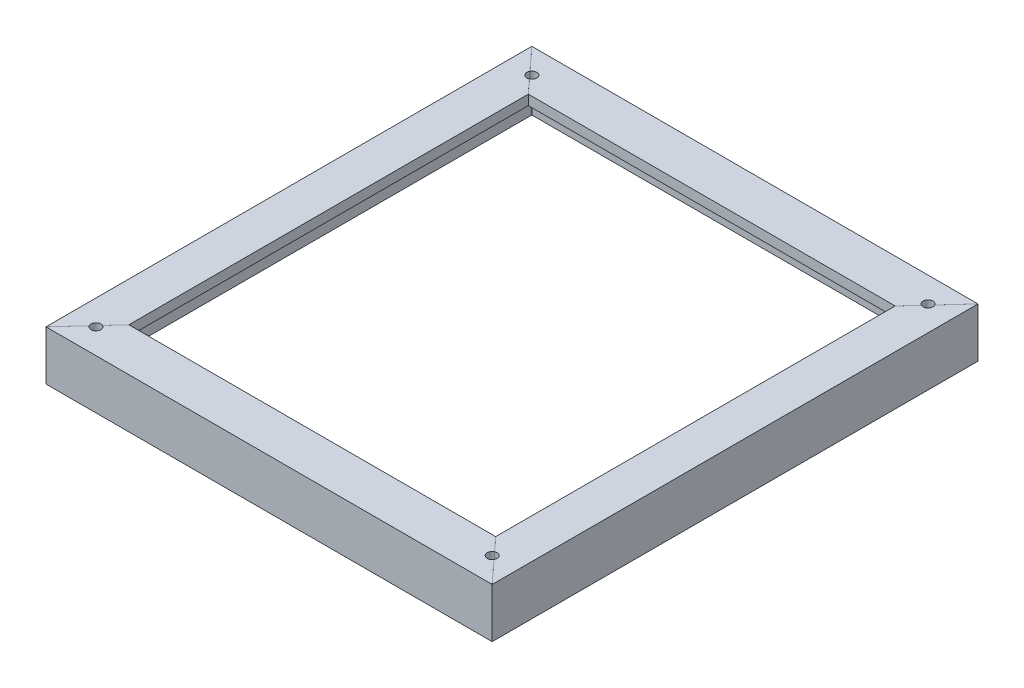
ISO-10303-21;
HEADER;
FILE_DESCRIPTION(('STEP AP214'),'2;1');
FILE_NAME('part.step','',(''),(''),'','','');
FILE_SCHEMA(('AUTOMOTIVE_DESIGN { 1 0 10303 214 1 1 1 1 }'));
ENDSEC;
DATA;
#1=APPLICATION_CONTEXT('core data for automotive mechanical design processes');
#2=APPLICATION_PROTOCOL_DEFINITION('international standard','automotive_design',2000,#1);
#3=PRODUCT_CONTEXT('',#1,'mechanical');
#4=PRODUCT('Part','Part','',(#3));
#5=PRODUCT_RELATED_PRODUCT_CATEGORY('part','',(#4));
#6=PRODUCT_DEFINITION_FORMATION('','',#4);
#7=PRODUCT_DEFINITION_CONTEXT('part definition',#1,'design');
#8=PRODUCT_DEFINITION('design','',#6,#7);
#9=PRODUCT_DEFINITION_SHAPE('','',#8);
#10=(LENGTH_UNIT() NAMED_UNIT(*) SI_UNIT(.MILLI.,.METRE.));
#11=(NAMED_UNIT(*) PLANE_ANGLE_UNIT() SI_UNIT($,.RADIAN.));
#12=(NAMED_UNIT(*) SI_UNIT($,.STERADIAN.) SOLID_ANGLE_UNIT());
#13=UNCERTAINTY_MEASURE_WITH_UNIT(LENGTH_MEASURE(1.E-05),#10,'distance_accuracy_value','');
#14=(GEOMETRIC_REPRESENTATION_CONTEXT(3) GLOBAL_UNCERTAINTY_ASSIGNED_CONTEXT((#13)) GLOBAL_UNIT_ASSIGNED_CONTEXT((#10,
#11,#12)) REPRESENTATION_CONTEXT('',''));
#15=CARTESIAN_POINT('',(0.,0.,0.));
#16=DIRECTION('',(0.,0.,1.));
#17=DIRECTION('',(1.,0.,0.));
#18=AXIS2_PLACEMENT_3D('',#15,#16,#17);
#19=CARTESIAN_POINT('',(0.,-3.175,0.));
#20=DIRECTION('',(0.,1.,0.));
#21=DIRECTION('',(0.,0.,1.));
#22=AXIS2_PLACEMENT_3D('',#19,#20,#21);
#23=PLANE('',#22);
#24=DIRECTION('',(-1.,0.,0.));
#25=VECTOR('',#24,1.);
#26=CARTESIAN_POINT('',(58.7375,-3.175,-63.9586111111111));
#27=LINE('',#26,#25);
#28=CARTESIAN_POINT('',(58.7340513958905,-3.175,-63.9586111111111));
#29=VERTEX_POINT('',#28);
#30=CARTESIAN_POINT('',(-58.7340513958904,-3.175,-63.9586111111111));
#31=VERTEX_POINT('',#30);
#32=EDGE_CURVE('E193',#29,#31,#27,.T.);
#33=ORIENTED_EDGE('',*,*,#32,.T.);
#34=DIRECTION('',(-0.676404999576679,0.,-0.736529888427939));
#35=VECTOR('',#34,1.);
#36=CARTESIAN_POINT('',(0.00187078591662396,-3.175,-0.00171806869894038));
#37=LINE('',#36,#35);
#38=CARTESIAN_POINT('',(-62.7632927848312,-3.175,-68.3460072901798));
#39=VERTEX_POINT('',#38);
#40=EDGE_CURVE('E145',#31,#39,#37,.T.);
#41=ORIENTED_EDGE('',*,*,#40,.T.);
#42=CARTESIAN_POINT('',(-63.4364999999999,-3.175,-69.7864999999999));
#43=DIRECTION('',(0.,-1.,0.));
#44=DIRECTION('',(0.,0.,-1.));
#45=AXIS2_PLACEMENT_3D('',#42,#43,#44);
#46=CIRCLE('',#45,1.59004);
#47=CARTESIAN_POINT('',(-64.8145946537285,-3.175,-70.5796471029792));
#48=VERTEX_POINT('',#47);
#49=EDGE_CURVE('E152',#48,#39,#46,.T.);
#50=ORIENTED_EDGE('',*,*,#49,.F.);
#51=CARTESIAN_POINT('',(-68.2624999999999,-3.175,-74.3340329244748));
#52=VERTEX_POINT('',#51);
#53=EDGE_CURVE('E137',#48,#52,#37,.T.);
#54=ORIENTED_EDGE('',*,*,#53,.T.);
#55=DIRECTION('',(0.,0.,-1.));
#56=VECTOR('',#55,1.);
#57=CARTESIAN_POINT('',(-68.2625,-3.175,-74.6125));
#58=LINE('',#57,#56);
#59=CARTESIAN_POINT('',(-68.2625,-3.175,-74.6125));
#60=VERTEX_POINT('',#59);
#61=EDGE_CURVE('E144',#52,#60,#58,.T.);
#62=ORIENTED_EDGE('',*,*,#61,.T.);
#63=DIRECTION('',(1.,0.,0.));
#64=VECTOR('',#63,1.);
#65=CARTESIAN_POINT('',(68.2625,-3.175,-74.6125));
#66=LINE('',#65,#64);
#67=CARTESIAN_POINT('',(68.2625,-3.175,-74.6125));
#68=VERTEX_POINT('',#67);
#69=EDGE_CURVE('E175',#60,#68,#66,.T.);
#70=ORIENTED_EDGE('',*,*,#69,.T.);
#71=DIRECTION('',(0.,0.,1.));
#72=VECTOR('',#71,1.);
#73=CARTESIAN_POINT('',(68.2625,-3.175,-74.6125));
#74=LINE('',#73,#72);
#75=CARTESIAN_POINT('',(68.2625,-3.175,-74.3340329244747));
#76=VERTEX_POINT('',#75);
#77=EDGE_CURVE('E176',#68,#76,#74,.T.);
#78=ORIENTED_EDGE('',*,*,#77,.T.);
#79=DIRECTION('',(-0.67640499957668,0.,0.736529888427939));
#80=VECTOR('',#79,1.);
#81=CARTESIAN_POINT('',(-0.00187078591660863,-3.175,-0.0017180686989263));
#82=LINE('',#81,#80);
#83=CARTESIAN_POINT('',(64.8145946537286,-3.175,-70.5796471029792));
#84=VERTEX_POINT('',#83);
#85=EDGE_CURVE('E178',#76,#84,#82,.T.);
#86=ORIENTED_EDGE('',*,*,#85,.T.);
#87=CARTESIAN_POINT('',(63.4364999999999,-3.175,-69.7864999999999));
#88=DIRECTION('',(0.,-1.,0.));
#89=DIRECTION('',(0.,0.,1.));
#90=AXIS2_PLACEMENT_3D('',#87,#88,#89);
#91=CIRCLE('',#90,1.59004000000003);
#92=CARTESIAN_POINT('',(62.7632927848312,-3.175,-68.3460072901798));
#93=VERTEX_POINT('',#92);
#94=EDGE_CURVE('E155',#93,#84,#91,.T.);
#95=ORIENTED_EDGE('',*,*,#94,.F.);
#96=EDGE_CURVE('E84',#93,#29,#82,.T.);
#97=ORIENTED_EDGE('',*,*,#96,.T.);
#98=EDGE_LOOP('',(#33,#41,#50,#54,#62,#70,#78,#86,#95,#97));
#99=FACE_BOUND('',#98,.T.);
#100=ADVANCED_FACE('F44',(#99),#23,.F.);
#101=CARTESIAN_POINT('',(0.,0.,0.));
#102=DIRECTION('',(0.,1.,0.));
#103=DIRECTION('',(0.,0.,1.));
#104=AXIS2_PLACEMENT_3D('',#101,#102,#103);
#105=PLANE('',#104);
#106=DIRECTION('',(-0.676404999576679,0.,-0.736529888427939));
#107=VECTOR('',#106,1.);
#108=CARTESIAN_POINT('',(-71.4356292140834,0.,-77.7892180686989));
#109=LINE('',#108,#107);
#110=CARTESIAN_POINT('',(-58.7340513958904,0.,-63.9586111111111));
#111=VERTEX_POINT('',#110);
#112=CARTESIAN_POINT('',(-62.7632927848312,0.,-68.3460072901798));
#113=VERTEX_POINT('',#112);
#114=EDGE_CURVE('E12',#111,#113,#109,.T.);
#115=ORIENTED_EDGE('',*,*,#114,.F.);
#116=DIRECTION('',(-1.,0.,0.));
#117=VECTOR('',#116,1.);
#118=CARTESIAN_POINT('',(58.7375,0.,-63.9586111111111));
#119=LINE('',#118,#117);
#120=CARTESIAN_POINT('',(58.7340513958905,0.,-63.9586111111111));
#121=VERTEX_POINT('',#120);
#122=EDGE_CURVE('E205',#121,#111,#119,.T.);
#123=ORIENTED_EDGE('',*,*,#122,.F.);
#124=DIRECTION('',(-0.67640499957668,0.,0.736529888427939));
#125=VECTOR('',#124,1.);
#126=CARTESIAN_POINT('',(71.4356292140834,0.,-77.7892180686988));
#127=LINE('',#126,#125);
#128=CARTESIAN_POINT('',(62.7632927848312,0.,-68.3460072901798));
#129=VERTEX_POINT('',#128);
#130=EDGE_CURVE('E198',#129,#121,#127,.T.);
#131=ORIENTED_EDGE('',*,*,#130,.F.);
#132=CARTESIAN_POINT('',(63.4364999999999,0.,-69.7864999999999));
#133=DIRECTION('',(0.,-1.,0.));
#134=DIRECTION('',(0.,0.,1.));
#135=AXIS2_PLACEMENT_3D('',#132,#133,#134);
#136=CIRCLE('',#135,1.59004000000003);
#137=CARTESIAN_POINT('',(64.8145946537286,0.,-70.5796471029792));
#138=VERTEX_POINT('',#137);
#139=EDGE_CURVE('E167',#129,#138,#136,.T.);
#140=ORIENTED_EDGE('',*,*,#139,.T.);
#141=CARTESIAN_POINT('',(71.4340513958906,0.,-77.7875));
#142=VERTEX_POINT('',#141);
#143=EDGE_CURVE('E215',#142,#138,#127,.T.);
#144=ORIENTED_EDGE('',*,*,#143,.F.);
#145=DIRECTION('',(-1.,0.,0.));
#146=VECTOR('',#145,1.);
#147=CARTESIAN_POINT('',(71.4375,0.,-77.7875));
#148=LINE('',#147,#146);
#149=CARTESIAN_POINT('',(-71.4340513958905,0.,-77.7875));
#150=VERTEX_POINT('',#149);
#151=EDGE_CURVE('E170',#142,#150,#148,.T.);
#152=ORIENTED_EDGE('',*,*,#151,.T.);
#153=CARTESIAN_POINT('',(-64.8145946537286,0.,-70.5796471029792));
#154=VERTEX_POINT('',#153);
#155=EDGE_CURVE('E53',#154,#150,#109,.T.);
#156=ORIENTED_EDGE('',*,*,#155,.F.);
#157=CARTESIAN_POINT('',(-63.4364999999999,0.,-69.7864999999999));
#158=DIRECTION('',(0.,-1.,0.));
#159=DIRECTION('',(0.,0.,-1.));
#160=AXIS2_PLACEMENT_3D('',#157,#158,#159);
#161=CIRCLE('',#160,1.59004);
#162=EDGE_CURVE('E154',#154,#113,#161,.T.);
#163=ORIENTED_EDGE('',*,*,#162,.T.);
#164=EDGE_LOOP('',(#115,#123,#131,#140,#144,#152,#156,#163));
#165=FACE_BOUND('',#164,.T.);
#166=ADVANCED_FACE('F235',(#165),#105,.T.);
#167=CARTESIAN_POINT('',(0.,-15.875,0.));
#168=DIRECTION('',(0.,-1.,0.));
#169=DIRECTION('',(0.,0.,-1.));
#170=AXIS2_PLACEMENT_3D('',#167,#168,#169);
#171=PLANE('',#170);
#172=DIRECTION('',(0.676404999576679,0.,0.736529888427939));
#173=VECTOR('',#172,1.);
#174=CARTESIAN_POINT('',(0.00187078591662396,-15.875,-0.00171806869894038));
#175=LINE('',#174,#173);
#176=CARTESIAN_POINT('',(-71.4340513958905,-15.875,-77.7875));
#177=VERTEX_POINT('',#176);
#178=CARTESIAN_POINT('',(-68.2625,-15.875,-74.3340329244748));
#179=VERTEX_POINT('',#178);
#180=EDGE_CURVE('E208',#177,#179,#175,.T.);
#181=ORIENTED_EDGE('',*,*,#180,.F.);
#182=DIRECTION('',(1.,0.,0.));
#183=VECTOR('',#182,1.);
#184=CARTESIAN_POINT('',(-71.4375,-15.875,-77.7875));
#185=LINE('',#184,#183);
#186=CARTESIAN_POINT('',(71.4340513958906,-15.875,-77.7875));
#187=VERTEX_POINT('',#186);
#188=EDGE_CURVE('E180',#177,#187,#185,.T.);
#189=ORIENTED_EDGE('',*,*,#188,.T.);
#190=DIRECTION('',(0.67640499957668,0.,-0.736529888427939));
#191=VECTOR('',#190,1.);
#192=CARTESIAN_POINT('',(-0.00187078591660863,-15.875,-0.0017180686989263));
#193=LINE('',#192,#191);
#194=CARTESIAN_POINT('',(68.2625,-15.875,-74.3340329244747));
#195=VERTEX_POINT('',#194);
#196=EDGE_CURVE('E209',#195,#187,#193,.T.);
#197=ORIENTED_EDGE('',*,*,#196,.F.);
#198=DIRECTION('',(0.,0.,1.));
#199=VECTOR('',#198,1.);
#200=CARTESIAN_POINT('',(68.2625,-15.875,-74.6125));
#201=LINE('',#200,#199);
#202=CARTESIAN_POINT('',(68.2625,-15.875,-74.6125));
#203=VERTEX_POINT('',#202);
#204=EDGE_CURVE('E47',#203,#195,#201,.T.);
#205=ORIENTED_EDGE('',*,*,#204,.F.);
#206=DIRECTION('',(1.,0.,0.));
#207=VECTOR('',#206,1.);
#208=CARTESIAN_POINT('',(68.2625,-15.875,-74.6125));
#209=LINE('',#208,#207);
#210=CARTESIAN_POINT('',(-68.2625,-15.875,-74.6125));
#211=VERTEX_POINT('',#210);
#212=EDGE_CURVE('E199',#211,#203,#209,.T.);
#213=ORIENTED_EDGE('',*,*,#212,.F.);
#214=DIRECTION('',(0.,0.,-1.));
#215=VECTOR('',#214,1.);
#216=CARTESIAN_POINT('',(-68.2625,-15.875,-74.6125));
#217=LINE('',#216,#215);
#218=EDGE_CURVE('E179',#179,#211,#217,.T.);
#219=ORIENTED_EDGE('',*,*,#218,.F.);
#220=EDGE_LOOP('',(#181,#189,#197,#205,#213,#219));
#221=FACE_BOUND('',#220,.T.);
#222=ADVANCED_FACE('F243',(#221),#171,.T.);
#223=CARTESIAN_POINT('',(-68.2625,-15.875,-74.6125));
#224=DIRECTION('',(1.,0.,0.));
#225=DIRECTION('',(0.,0.,-1.));
#226=AXIS2_PLACEMENT_3D('',#223,#224,#225);
#227=PLANE('',#226);
#228=DIRECTION('',(0.,1.,0.));
#229=VECTOR('',#228,1.);
#230=CARTESIAN_POINT('',(-68.2625,-15.875,-74.3340329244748));
#231=LINE('',#230,#229);
#232=EDGE_CURVE('E140',#179,#52,#231,.T.);
#233=ORIENTED_EDGE('',*,*,#232,.F.);
#234=ORIENTED_EDGE('',*,*,#218,.T.);
#235=DIRECTION('',(0.,1.,0.));
#236=VECTOR('',#235,1.);
#237=CARTESIAN_POINT('',(-68.2625,-15.875,-74.6125));
#238=LINE('',#237,#236);
#239=EDGE_CURVE('E163',#211,#60,#238,.T.);
#240=ORIENTED_EDGE('',*,*,#239,.T.);
#241=ORIENTED_EDGE('',*,*,#61,.F.);
#242=EDGE_LOOP('',(#233,#234,#240,#241));
#243=FACE_BOUND('',#242,.T.);
#244=ADVANCED_FACE('F254',(#243),#227,.T.);
#245=CARTESIAN_POINT('',(68.2625,-15.875,-74.6125));
#246=DIRECTION('',(-1.,0.,0.));
#247=DIRECTION('',(0.,0.,1.));
#248=AXIS2_PLACEMENT_3D('',#245,#246,#247);
#249=PLANE('',#248);
#250=DIRECTION('',(0.,-1.,0.));
#251=VECTOR('',#250,1.);
#252=CARTESIAN_POINT('',(68.2625,-15.875,-74.3340329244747));
#253=LINE('',#252,#251);
#254=EDGE_CURVE('E217',#76,#195,#253,.T.);
#255=ORIENTED_EDGE('',*,*,#254,.F.);
#256=ORIENTED_EDGE('',*,*,#77,.F.);
#257=DIRECTION('',(0.,1.,0.));
#258=VECTOR('',#257,1.);
#259=CARTESIAN_POINT('',(68.2625,-15.875,-74.6125));
#260=LINE('',#259,#258);
#261=EDGE_CURVE('E196',#203,#68,#260,.T.);
#262=ORIENTED_EDGE('',*,*,#261,.F.);
#263=ORIENTED_EDGE('',*,*,#204,.T.);
#264=EDGE_LOOP('',(#255,#256,#262,#263));
#265=FACE_BOUND('',#264,.T.);
#266=ADVANCED_FACE('F253',(#265),#249,.T.);
#267=CARTESIAN_POINT('',(-63.4364999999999,0.,-69.7864999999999));
#268=DIRECTION('',(0.,-1.,0.));
#269=DIRECTION('',(0.,0.,-1.));
#270=AXIS2_PLACEMENT_3D('',#267,#268,#269);
#271=CYLINDRICAL_SURFACE('',#270,1.59004);
#272=ORIENTED_EDGE('',*,*,#49,.T.);
#273=DIRECTION('',(0.,-1.,0.));
#274=VECTOR('',#273,1.);
#275=CARTESIAN_POINT('',(-62.7632927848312,0.,-68.3460072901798));
#276=LINE('',#275,#274);
#277=EDGE_CURVE('E156',#39,#113,#276,.F.);
#278=ORIENTED_EDGE('',*,*,#277,.T.);
#279=ORIENTED_EDGE('',*,*,#162,.F.);
#280=DIRECTION('',(0.,-1.,0.));
#281=VECTOR('',#280,1.);
#282=CARTESIAN_POINT('',(-64.8145946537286,0.,-70.5796471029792));
#283=LINE('',#282,#281);
#284=EDGE_CURVE('E135',#154,#48,#283,.T.);
#285=ORIENTED_EDGE('',*,*,#284,.T.);
#286=EDGE_LOOP('',(#272,#278,#279,#285));
#287=FACE_BOUND('',#286,.T.);
#288=ADVANCED_FACE('F150',(#287),#271,.F.);
#289=CARTESIAN_POINT('',(63.4364999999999,0.,-69.7864999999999));
#290=DIRECTION('',(0.,-1.,0.));
#291=DIRECTION('',(0.,0.,-1.));
#292=AXIS2_PLACEMENT_3D('',#289,#290,#291);
#293=CYLINDRICAL_SURFACE('',#292,1.59004000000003);
#294=ORIENTED_EDGE('',*,*,#94,.T.);
#295=DIRECTION('',(0.,-1.,0.));
#296=VECTOR('',#295,1.);
#297=CARTESIAN_POINT('',(64.8145946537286,0.,-70.5796471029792));
#298=LINE('',#297,#296);
#299=EDGE_CURVE('E173',#84,#138,#298,.F.);
#300=ORIENTED_EDGE('',*,*,#299,.T.);
#301=ORIENTED_EDGE('',*,*,#139,.F.);
#302=DIRECTION('',(0.,-1.,0.));
#303=VECTOR('',#302,1.);
#304=CARTESIAN_POINT('',(62.7632927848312,0.,-68.3460072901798));
#305=LINE('',#304,#303);
#306=EDGE_CURVE('E78',#129,#93,#305,.T.);
#307=ORIENTED_EDGE('',*,*,#306,.T.);
#308=EDGE_LOOP('',(#294,#300,#301,#307));
#309=FACE_BOUND('',#308,.T.);
#310=ADVANCED_FACE('F232',(#309),#293,.F.);
#311=CARTESIAN_POINT('',(71.4375,-3.175,-77.7875));
#312=DIRECTION('',(0.,0.,-1.));
#313=DIRECTION('',(-1.,0.,0.));
#314=AXIS2_PLACEMENT_3D('',#311,#312,#313);
#315=PLANE('',#314);
#316=DIRECTION('',(0.,-1.,0.));
#317=VECTOR('',#316,1.);
#318=CARTESIAN_POINT('',(-71.4340513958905,-3.175,-77.7875));
#319=LINE('',#318,#317);
#320=EDGE_CURVE('E206',#150,#177,#319,.T.);
#321=ORIENTED_EDGE('',*,*,#320,.F.);
#322=ORIENTED_EDGE('',*,*,#151,.F.);
#323=DIRECTION('',(0.,1.,0.));
#324=VECTOR('',#323,1.);
#325=CARTESIAN_POINT('',(71.4340513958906,-3.175,-77.7875));
#326=LINE('',#325,#324);
#327=EDGE_CURVE('E212',#187,#142,#326,.T.);
#328=ORIENTED_EDGE('',*,*,#327,.F.);
#329=ORIENTED_EDGE('',*,*,#188,.F.);
#330=EDGE_LOOP('',(#321,#322,#328,#329));
#331=FACE_BOUND('',#330,.T.);
#332=ADVANCED_FACE('F242',(#331),#315,.T.);
#333=CARTESIAN_POINT('',(58.7375,-3.175,-63.9586111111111));
#334=DIRECTION('',(0.,0.,-1.));
#335=DIRECTION('',(-1.,0.,0.));
#336=AXIS2_PLACEMENT_3D('',#333,#334,#335);
#337=PLANE('',#336);
#338=ORIENTED_EDGE('',*,*,#122,.T.);
#339=DIRECTION('',(0.,-1.,0.));
#340=VECTOR('',#339,1.);
#341=CARTESIAN_POINT('',(-58.7340513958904,-3.175,-63.9586111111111));
#342=LINE('',#341,#340);
#343=EDGE_CURVE('E61',#111,#31,#342,.T.);
#344=ORIENTED_EDGE('',*,*,#343,.T.);
#345=ORIENTED_EDGE('',*,*,#32,.F.);
#346=DIRECTION('',(0.,1.,0.));
#347=VECTOR('',#346,1.);
#348=CARTESIAN_POINT('',(58.7340513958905,-3.175,-63.9586111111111));
#349=LINE('',#348,#347);
#350=EDGE_CURVE('E203',#29,#121,#349,.T.);
#351=ORIENTED_EDGE('',*,*,#350,.T.);
#352=EDGE_LOOP('',(#338,#344,#345,#351));
#353=FACE_BOUND('',#352,.T.);
#354=ADVANCED_FACE('F308',(#353),#337,.F.);
#355=CARTESIAN_POINT('',(68.2625,-15.875,-74.6125));
#356=DIRECTION('',(0.,0.,1.));
#357=DIRECTION('',(1.,0.,0.));
#358=AXIS2_PLACEMENT_3D('',#355,#356,#357);
#359=PLANE('',#358);
#360=ORIENTED_EDGE('',*,*,#69,.F.);
#361=ORIENTED_EDGE('',*,*,#239,.F.);
#362=ORIENTED_EDGE('',*,*,#212,.T.);
#363=ORIENTED_EDGE('',*,*,#261,.T.);
#364=EDGE_LOOP('',(#360,#361,#362,#363));
#365=FACE_BOUND('',#364,.T.);
#366=ADVANCED_FACE('F249',(#365),#359,.T.);
#367=CARTESIAN_POINT('',(71.4356292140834,-2540.,-77.7892180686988));
#368=DIRECTION('',(-0.736529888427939,0.,-0.676404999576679));
#369=DIRECTION('',(-0.67640499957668,0.,0.736529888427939));
#370=AXIS2_PLACEMENT_3D('',#367,#368,#369);
#371=PLANE('',#370);
#372=ORIENTED_EDGE('',*,*,#96,.F.);
#373=ORIENTED_EDGE('',*,*,#306,.F.);
#374=ORIENTED_EDGE('',*,*,#130,.T.);
#375=ORIENTED_EDGE('',*,*,#350,.F.);
#376=EDGE_LOOP('',(#372,#373,#374,#375));
#377=FACE_BOUND('',#376,.T.);
#378=ADVANCED_FACE('F326',(#377),#371,.F.);
#379=ORIENTED_EDGE('',*,*,#327,.T.);
#380=ORIENTED_EDGE('',*,*,#143,.T.);
#381=ORIENTED_EDGE('',*,*,#299,.F.);
#382=ORIENTED_EDGE('',*,*,#85,.F.);
#383=ORIENTED_EDGE('',*,*,#254,.T.);
#384=ORIENTED_EDGE('',*,*,#196,.T.);
#385=EDGE_LOOP('',(#379,#380,#381,#382,#383,#384));
#386=FACE_BOUND('',#385,.T.);
#387=ADVANCED_FACE('F224',(#386),#371,.F.);
#388=CARTESIAN_POINT('',(-71.4356292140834,-2540.,-77.7892180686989));
#389=DIRECTION('',(0.736529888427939,0.,-0.676404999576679));
#390=DIRECTION('',(-0.676404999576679,0.,-0.736529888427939));
#391=AXIS2_PLACEMENT_3D('',#388,#389,#390);
#392=PLANE('',#391);
#393=ORIENTED_EDGE('',*,*,#320,.T.);
#394=ORIENTED_EDGE('',*,*,#180,.T.);
#395=ORIENTED_EDGE('',*,*,#232,.T.);
#396=ORIENTED_EDGE('',*,*,#53,.F.);
#397=ORIENTED_EDGE('',*,*,#284,.F.);
#398=ORIENTED_EDGE('',*,*,#155,.T.);
#399=EDGE_LOOP('',(#393,#394,#395,#396,#397,#398));
#400=FACE_BOUND('',#399,.T.);
#401=ADVANCED_FACE('F138',(#400),#392,.F.);
#402=ORIENTED_EDGE('',*,*,#114,.T.);
#403=ORIENTED_EDGE('',*,*,#277,.F.);
#404=ORIENTED_EDGE('',*,*,#40,.F.);
#405=ORIENTED_EDGE('',*,*,#343,.F.);
#406=EDGE_LOOP('',(#402,#403,#404,#405));
#407=FACE_BOUND('',#406,.T.);
#408=ADVANCED_FACE('F350',(#407),#392,.F.);
#409=CLOSED_SHELL('',(#100,#166,#222,#244,#266,#288,#310,#332,#354,#366,#378,#387,#401,#408));
#410=MANIFOLD_SOLID_BREP('B2',#409);
#411=CARTESIAN_POINT('',(68.2625,-15.875,74.6125));
#412=DIRECTION('',(0.,0.,-1.));
#413=DIRECTION('',(-1.,0.,0.));
#414=AXIS2_PLACEMENT_3D('',#411,#412,#413);
#415=PLANE('',#414);
#416=DIRECTION('',(-1.,0.,0.));
#417=VECTOR('',#416,1.);
#418=CARTESIAN_POINT('',(68.2625,-3.175,74.6125));
#419=LINE('',#418,#417);
#420=CARTESIAN_POINT('',(68.2625,-3.175,74.6125));
#421=VERTEX_POINT('',#420);
#422=CARTESIAN_POINT('',(-68.2625,-3.175,74.6125));
#423=VERTEX_POINT('',#422);
#424=EDGE_CURVE('E479',#421,#423,#419,.T.);
#425=ORIENTED_EDGE('',*,*,#424,.F.);
#426=DIRECTION('',(0.,1.,0.));
#427=VECTOR('',#426,1.);
#428=CARTESIAN_POINT('',(68.2625,-15.875,74.6125));
#429=LINE('',#428,#427);
#430=CARTESIAN_POINT('',(68.2625,-15.875,74.6125));
#431=VERTEX_POINT('',#430);
#432=EDGE_CURVE('E485',#431,#421,#429,.T.);
#433=ORIENTED_EDGE('',*,*,#432,.F.);
#434=DIRECTION('',(-1.,0.,0.));
#435=VECTOR('',#434,1.);
#436=CARTESIAN_POINT('',(68.2625,-15.875,74.6125));
#437=LINE('',#436,#435);
#438=CARTESIAN_POINT('',(-68.2625,-15.875,74.6125));
#439=VERTEX_POINT('',#438);
#440=EDGE_CURVE('E502',#431,#439,#437,.T.);
#441=ORIENTED_EDGE('',*,*,#440,.T.);
#442=DIRECTION('',(0.,1.,0.));
#443=VECTOR('',#442,1.);
#444=CARTESIAN_POINT('',(-68.2625,-15.875,74.6125));
#445=LINE('',#444,#443);
#446=EDGE_CURVE('E494',#439,#423,#445,.T.);
#447=ORIENTED_EDGE('',*,*,#446,.T.);
#448=EDGE_LOOP('',(#425,#433,#441,#447));
#449=FACE_BOUND('',#448,.T.);
#450=ADVANCED_FACE('F383',(#449),#415,.T.);
#451=CARTESIAN_POINT('',(68.2625,-15.875,-74.6125));
#452=DIRECTION('',(-1.,0.,0.));
#453=DIRECTION('',(0.,0.,1.));
#454=AXIS2_PLACEMENT_3D('',#451,#452,#453);
#455=PLANE('',#454);
#456=DIRECTION('',(0.,1.,0.));
#457=VECTOR('',#456,1.);
#458=CARTESIAN_POINT('',(68.2625,-15.875,74.3340329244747));
#459=LINE('',#458,#457);
#460=CARTESIAN_POINT('',(68.2625,-15.875,74.3340329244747));
#461=VERTEX_POINT('',#460);
#462=CARTESIAN_POINT('',(68.2625,-3.175,74.3340329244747));
#463=VERTEX_POINT('',#462);
#464=EDGE_CURVE('E522',#461,#463,#459,.T.);
#465=ORIENTED_EDGE('',*,*,#464,.F.);
#466=DIRECTION('',(0.,0.,1.));
#467=VECTOR('',#466,1.);
#468=CARTESIAN_POINT('',(68.2625,-15.875,-74.6125));
#469=LINE('',#468,#467);
#470=EDGE_CURVE('E387',#461,#431,#469,.T.);
#471=ORIENTED_EDGE('',*,*,#470,.T.);
#472=ORIENTED_EDGE('',*,*,#432,.T.);
#473=DIRECTION('',(0.,0.,1.));
#474=VECTOR('',#473,1.);
#475=CARTESIAN_POINT('',(68.2625,-3.175,-74.6125));
#476=LINE('',#475,#474);
#477=EDGE_CURVE('E474',#463,#421,#476,.T.);
#478=ORIENTED_EDGE('',*,*,#477,.F.);
#479=EDGE_LOOP('',(#465,#471,#472,#478));
#480=FACE_BOUND('',#479,.T.);
#481=ADVANCED_FACE('F486',(#480),#455,.T.);
#482=CARTESIAN_POINT('',(-68.2625,-15.875,-74.6125));
#483=DIRECTION('',(1.,0.,0.));
#484=DIRECTION('',(0.,0.,-1.));
#485=AXIS2_PLACEMENT_3D('',#482,#483,#484);
#486=PLANE('',#485);
#487=DIRECTION('',(0.,-1.,0.));
#488=VECTOR('',#487,1.);
#489=CARTESIAN_POINT('',(-68.2625,-15.875,74.3340329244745));
#490=LINE('',#489,#488);
#491=CARTESIAN_POINT('',(-68.2625,-3.175,74.3340329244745));
#492=VERTEX_POINT('',#491);
#493=CARTESIAN_POINT('',(-68.2625,-15.875,74.3340329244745));
#494=VERTEX_POINT('',#493);
#495=EDGE_CURVE('E393',#492,#494,#490,.T.);
#496=ORIENTED_EDGE('',*,*,#495,.F.);
#497=DIRECTION('',(0.,0.,-1.));
#498=VECTOR('',#497,1.);
#499=CARTESIAN_POINT('',(-68.2625,-3.175,-74.6125));
#500=LINE('',#499,#498);
#501=EDGE_CURVE('E496',#423,#492,#500,.T.);
#502=ORIENTED_EDGE('',*,*,#501,.F.);
#503=ORIENTED_EDGE('',*,*,#446,.F.);
#504=DIRECTION('',(0.,0.,-1.));
#505=VECTOR('',#504,1.);
#506=CARTESIAN_POINT('',(-68.2625,-15.875,-74.6125));
#507=LINE('',#506,#505);
#508=EDGE_CURVE('E491',#439,#494,#507,.T.);
#509=ORIENTED_EDGE('',*,*,#508,.T.);
#510=EDGE_LOOP('',(#496,#502,#503,#509));
#511=FACE_BOUND('',#510,.T.);
#512=ADVANCED_FACE('F585',(#511),#486,.T.);
#513=CARTESIAN_POINT('',(0.,-15.875,0.));
#514=DIRECTION('',(0.,-1.,0.));
#515=DIRECTION('',(0.,0.,-1.));
#516=AXIS2_PLACEMENT_3D('',#513,#514,#515);
#517=PLANE('',#516);
#518=DIRECTION('',(-0.676404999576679,0.,-0.736529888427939));
#519=VECTOR('',#518,1.);
#520=CARTESIAN_POINT('',(-0.00187078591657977,-15.875,0.00171806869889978));
#521=LINE('',#520,#519);
#522=CARTESIAN_POINT('',(71.4340513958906,-15.875,77.7875));
#523=VERTEX_POINT('',#522);
#524=EDGE_CURVE('E520',#523,#461,#521,.T.);
#525=ORIENTED_EDGE('',*,*,#524,.F.);
#526=DIRECTION('',(-1.,0.,0.));
#527=VECTOR('',#526,1.);
#528=CARTESIAN_POINT('',(71.4375,-15.875,77.7875));
#529=LINE('',#528,#527);
#530=CARTESIAN_POINT('',(-71.4340513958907,-15.875,77.7875));
#531=VERTEX_POINT('',#530);
#532=EDGE_CURVE('E531',#523,#531,#529,.T.);
#533=ORIENTED_EDGE('',*,*,#532,.T.);
#534=DIRECTION('',(-0.67640499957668,0.,0.736529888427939));
#535=VECTOR('',#534,1.);
#536=CARTESIAN_POINT('',(0.00187078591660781,-15.875,0.00171806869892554));
#537=LINE('',#536,#535);
#538=EDGE_CURVE('E42',#494,#531,#537,.T.);
#539=ORIENTED_EDGE('',*,*,#538,.F.);
#540=ORIENTED_EDGE('',*,*,#508,.F.);
#541=ORIENTED_EDGE('',*,*,#440,.F.);
#542=ORIENTED_EDGE('',*,*,#470,.F.);
#543=EDGE_LOOP('',(#525,#533,#539,#540,#541,#542));
#544=FACE_BOUND('',#543,.T.);
#545=ADVANCED_FACE('F587',(#544),#517,.T.);
#546=CARTESIAN_POINT('',(63.4364999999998,0.,69.7865));
#547=DIRECTION('',(0.,-1.,0.));
#548=DIRECTION('',(0.,0.,-1.));
#549=AXIS2_PLACEMENT_3D('',#546,#547,#548);
#550=CYLINDRICAL_SURFACE('',#549,1.59004);
#551=CARTESIAN_POINT('',(63.4364999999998,-3.175,69.7865));
#552=DIRECTION('',(0.,-1.,0.));
#553=DIRECTION('',(0.,0.,1.));
#554=AXIS2_PLACEMENT_3D('',#551,#552,#553);
#555=CIRCLE('',#554,1.59004);
#556=CARTESIAN_POINT('',(64.8145946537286,-3.175,70.5796471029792));
#557=VERTEX_POINT('',#556);
#558=CARTESIAN_POINT('',(62.7632927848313,-3.175,68.3460072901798));
#559=VERTEX_POINT('',#558);
#560=EDGE_CURVE('E545',#557,#559,#555,.T.);
#561=ORIENTED_EDGE('',*,*,#560,.T.);
#562=DIRECTION('',(0.,-1.,0.));
#563=VECTOR('',#562,1.);
#564=CARTESIAN_POINT('',(62.7632927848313,0.,68.3460072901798));
#565=LINE('',#564,#563);
#566=CARTESIAN_POINT('',(62.7632927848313,0.,68.3460072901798));
#567=VERTEX_POINT('',#566);
#568=EDGE_CURVE('E547',#559,#567,#565,.F.);
#569=ORIENTED_EDGE('',*,*,#568,.T.);
#570=CARTESIAN_POINT('',(63.4364999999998,0.,69.7865));
#571=DIRECTION('',(0.,-1.,0.));
#572=DIRECTION('',(0.,0.,1.));
#573=AXIS2_PLACEMENT_3D('',#570,#571,#572);
#574=CIRCLE('',#573,1.59004);
#575=CARTESIAN_POINT('',(64.8145946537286,0.,70.5796471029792));
#576=VERTEX_POINT('',#575);
#577=EDGE_CURVE('E541',#576,#567,#574,.T.);
#578=ORIENTED_EDGE('',*,*,#577,.F.);
#579=DIRECTION('',(0.,-1.,0.));
#580=VECTOR('',#579,1.);
#581=CARTESIAN_POINT('',(64.8145946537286,0.,70.5796471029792));
#582=LINE('',#581,#580);
#583=EDGE_CURVE('E540',#576,#557,#582,.T.);
#584=ORIENTED_EDGE('',*,*,#583,.T.);
#585=EDGE_LOOP('',(#561,#569,#578,#584));
#586=FACE_BOUND('',#585,.T.);
#587=ADVANCED_FACE('F594',(#586),#550,.F.);
#588=CARTESIAN_POINT('',(-63.4364999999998,0.,69.7865));
#589=DIRECTION('',(0.,-1.,0.));
#590=DIRECTION('',(0.,0.,-1.));
#591=AXIS2_PLACEMENT_3D('',#588,#589,#590);
#592=CYLINDRICAL_SURFACE('',#591,1.59004000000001);
#593=CARTESIAN_POINT('',(-63.4364999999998,-3.175,69.7865));
#594=DIRECTION('',(0.,-1.,0.));
#595=DIRECTION('',(0.,0.,-1.));
#596=AXIS2_PLACEMENT_3D('',#593,#594,#595);
#597=CIRCLE('',#596,1.59004000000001);
#598=CARTESIAN_POINT('',(-62.7632927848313,-3.175,68.3460072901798));
#599=VERTEX_POINT('',#598);
#600=CARTESIAN_POINT('',(-64.8145946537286,-3.175,70.5796471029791));
#601=VERTEX_POINT('',#600);
#602=EDGE_CURVE('E536',#599,#601,#597,.T.);
#603=ORIENTED_EDGE('',*,*,#602,.T.);
#604=DIRECTION('',(0.,-1.,0.));
#605=VECTOR('',#604,1.);
#606=CARTESIAN_POINT('',(-64.8145946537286,0.,70.5796471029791));
#607=LINE('',#606,#605);
#608=CARTESIAN_POINT('',(-64.8145946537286,0.,70.5796471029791));
#609=VERTEX_POINT('',#608);
#610=EDGE_CURVE('E539',#601,#609,#607,.F.);
#611=ORIENTED_EDGE('',*,*,#610,.T.);
#612=CARTESIAN_POINT('',(-63.4364999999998,0.,69.7865));
#613=DIRECTION('',(0.,-1.,0.));
#614=DIRECTION('',(0.,0.,-1.));
#615=AXIS2_PLACEMENT_3D('',#612,#613,#614);
#616=CIRCLE('',#615,1.59004000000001);
#617=CARTESIAN_POINT('',(-62.7632927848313,0.,68.3460072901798));
#618=VERTEX_POINT('',#617);
#619=EDGE_CURVE('E512',#618,#609,#616,.T.);
#620=ORIENTED_EDGE('',*,*,#619,.F.);
#621=DIRECTION('',(0.,-1.,0.));
#622=VECTOR('',#621,1.);
#623=CARTESIAN_POINT('',(-62.7632927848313,0.,68.3460072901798));
#624=LINE('',#623,#622);
#625=EDGE_CURVE('E452',#618,#599,#624,.T.);
#626=ORIENTED_EDGE('',*,*,#625,.T.);
#627=EDGE_LOOP('',(#603,#611,#620,#626));
#628=FACE_BOUND('',#627,.T.);
#629=ADVANCED_FACE('F568',(#628),#592,.F.);
#630=CARTESIAN_POINT('',(58.7375,-3.175,63.9586111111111));
#631=DIRECTION('',(0.,0.,1.));
#632=DIRECTION('',(1.,0.,0.));
#633=AXIS2_PLACEMENT_3D('',#630,#631,#632);
#634=PLANE('',#633);
#635=DIRECTION('',(1.,0.,0.));
#636=VECTOR('',#635,1.);
#637=CARTESIAN_POINT('',(58.7375,0.,63.9586111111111));
#638=LINE('',#637,#636);
#639=CARTESIAN_POINT('',(-58.7340513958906,0.,63.9586111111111));
#640=VERTEX_POINT('',#639);
#641=CARTESIAN_POINT('',(58.7340513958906,0.,63.9586111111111));
#642=VERTEX_POINT('',#641);
#643=EDGE_CURVE('E518',#640,#642,#638,.T.);
#644=ORIENTED_EDGE('',*,*,#643,.T.);
#645=DIRECTION('',(0.,-1.,0.));
#646=VECTOR('',#645,1.);
#647=CARTESIAN_POINT('',(58.7340513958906,-3.175,63.9586111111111));
#648=LINE('',#647,#646);
#649=CARTESIAN_POINT('',(58.7340513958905,-3.175,63.9586111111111));
#650=VERTEX_POINT('',#649);
#651=EDGE_CURVE('E513',#642,#650,#648,.T.);
#652=ORIENTED_EDGE('',*,*,#651,.T.);
#653=DIRECTION('',(1.,0.,0.));
#654=VECTOR('',#653,1.);
#655=CARTESIAN_POINT('',(58.7375,-3.175,63.9586111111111));
#656=LINE('',#655,#654);
#657=CARTESIAN_POINT('',(-58.7340513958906,-3.175,63.9586111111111));
#658=VERTEX_POINT('',#657);
#659=EDGE_CURVE('E544',#658,#650,#656,.T.);
#660=ORIENTED_EDGE('',*,*,#659,.F.);
#661=DIRECTION('',(0.,1.,0.));
#662=VECTOR('',#661,1.);
#663=CARTESIAN_POINT('',(-58.7340513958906,-3.175,63.9586111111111));
#664=LINE('',#663,#662);
#665=EDGE_CURVE('E509',#658,#640,#664,.T.);
#666=ORIENTED_EDGE('',*,*,#665,.T.);
#667=EDGE_LOOP('',(#644,#652,#660,#666));
#668=FACE_BOUND('',#667,.T.);
#669=ADVANCED_FACE('F580',(#668),#634,.F.);
#670=CARTESIAN_POINT('',(0.,0.,0.));
#671=DIRECTION('',(0.,1.,0.));
#672=DIRECTION('',(0.,0.,1.));
#673=AXIS2_PLACEMENT_3D('',#670,#671,#672);
#674=PLANE('',#673);
#675=DIRECTION('',(0.676404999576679,0.,0.736529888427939));
#676=VECTOR('',#675,1.);
#677=CARTESIAN_POINT('',(0.,0.,0.00375514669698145));
#678=LINE('',#677,#676);
#679=EDGE_CURVE('E528',#642,#567,#678,.T.);
#680=ORIENTED_EDGE('',*,*,#679,.F.);
#681=ORIENTED_EDGE('',*,*,#643,.F.);
#682=DIRECTION('',(0.67640499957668,0.,-0.736529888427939));
#683=VECTOR('',#682,1.);
#684=CARTESIAN_POINT('',(0.,0.,0.00375514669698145));
#685=LINE('',#684,#683);
#686=EDGE_CURVE('E506',#618,#640,#685,.T.);
#687=ORIENTED_EDGE('',*,*,#686,.F.);
#688=ORIENTED_EDGE('',*,*,#619,.T.);
#689=CARTESIAN_POINT('',(-71.4340513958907,0.,77.7875));
#690=VERTEX_POINT('',#689);
#691=EDGE_CURVE('E505',#690,#609,#685,.T.);
#692=ORIENTED_EDGE('',*,*,#691,.F.);
#693=DIRECTION('',(1.,0.,0.));
#694=VECTOR('',#693,1.);
#695=CARTESIAN_POINT('',(71.4375,0.,77.7875));
#696=LINE('',#695,#694);
#697=CARTESIAN_POINT('',(71.4340513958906,0.,77.7875));
#698=VERTEX_POINT('',#697);
#699=EDGE_CURVE('E535',#690,#698,#696,.T.);
#700=ORIENTED_EDGE('',*,*,#699,.T.);
#701=EDGE_CURVE('E524',#576,#698,#678,.T.);
#702=ORIENTED_EDGE('',*,*,#701,.F.);
#703=ORIENTED_EDGE('',*,*,#577,.T.);
#704=EDGE_LOOP('',(#680,#681,#687,#688,#692,#700,#702,#703));
#705=FACE_BOUND('',#704,.T.);
#706=ADVANCED_FACE('F574',(#705),#674,.T.);
#707=CARTESIAN_POINT('',(0.,-3.175,0.));
#708=DIRECTION('',(0.,1.,0.));
#709=DIRECTION('',(0.,0.,1.));
#710=AXIS2_PLACEMENT_3D('',#707,#708,#709);
#711=PLANE('',#710);
#712=ORIENTED_EDGE('',*,*,#659,.T.);
#713=DIRECTION('',(0.676404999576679,0.,0.736529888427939));
#714=VECTOR('',#713,1.);
#715=CARTESIAN_POINT('',(-0.00187078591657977,-3.175,0.00171806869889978));
#716=LINE('',#715,#714);
#717=EDGE_CURVE('E526',#650,#559,#716,.T.);
#718=ORIENTED_EDGE('',*,*,#717,.T.);
#719=ORIENTED_EDGE('',*,*,#560,.F.);
#720=EDGE_CURVE('E481',#557,#463,#716,.T.);
#721=ORIENTED_EDGE('',*,*,#720,.T.);
#722=ORIENTED_EDGE('',*,*,#477,.T.);
#723=ORIENTED_EDGE('',*,*,#424,.T.);
#724=ORIENTED_EDGE('',*,*,#501,.T.);
#725=DIRECTION('',(0.67640499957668,0.,-0.736529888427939));
#726=VECTOR('',#725,1.);
#727=CARTESIAN_POINT('',(0.00187078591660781,-3.175,0.00171806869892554));
#728=LINE('',#727,#726);
#729=EDGE_CURVE('E498',#492,#601,#728,.T.);
#730=ORIENTED_EDGE('',*,*,#729,.T.);
#731=ORIENTED_EDGE('',*,*,#602,.F.);
#732=EDGE_CURVE('E456',#599,#658,#728,.T.);
#733=ORIENTED_EDGE('',*,*,#732,.T.);
#734=EDGE_LOOP('',(#712,#718,#719,#721,#722,#723,#724,#730,#731,#733));
#735=FACE_BOUND('',#734,.T.);
#736=ADVANCED_FACE('F385',(#735),#711,.F.);
#737=CARTESIAN_POINT('',(71.4375,-3.175,77.7875));
#738=DIRECTION('',(0.,0.,1.));
#739=DIRECTION('',(1.,0.,0.));
#740=AXIS2_PLACEMENT_3D('',#737,#738,#739);
#741=PLANE('',#740);
#742=DIRECTION('',(0.,-1.,0.));
#743=VECTOR('',#742,1.);
#744=CARTESIAN_POINT('',(71.4340513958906,-3.175,77.7875));
#745=LINE('',#744,#743);
#746=EDGE_CURVE('E515',#698,#523,#745,.T.);
#747=ORIENTED_EDGE('',*,*,#746,.F.);
#748=ORIENTED_EDGE('',*,*,#699,.F.);
#749=DIRECTION('',(0.,1.,0.));
#750=VECTOR('',#749,1.);
#751=CARTESIAN_POINT('',(-71.4340513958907,-3.175,77.7875));
#752=LINE('',#751,#750);
#753=EDGE_CURVE('E504',#531,#690,#752,.T.);
#754=ORIENTED_EDGE('',*,*,#753,.F.);
#755=ORIENTED_EDGE('',*,*,#532,.F.);
#756=EDGE_LOOP('',(#747,#748,#754,#755));
#757=FACE_BOUND('',#756,.T.);
#758=ADVANCED_FACE('F591',(#757),#741,.T.);
#759=CARTESIAN_POINT('',(0.,-2540.,0.00375514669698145));
#760=DIRECTION('',(-0.736529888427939,0.,0.676404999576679));
#761=DIRECTION('',(0.676404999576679,0.,0.736529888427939));
#762=AXIS2_PLACEMENT_3D('',#759,#760,#761);
#763=PLANE('',#762);
#764=ORIENTED_EDGE('',*,*,#746,.T.);
#765=ORIENTED_EDGE('',*,*,#524,.T.);
#766=ORIENTED_EDGE('',*,*,#464,.T.);
#767=ORIENTED_EDGE('',*,*,#720,.F.);
#768=ORIENTED_EDGE('',*,*,#583,.F.);
#769=ORIENTED_EDGE('',*,*,#701,.T.);
#770=EDGE_LOOP('',(#764,#765,#766,#767,#768,#769));
#771=FACE_BOUND('',#770,.T.);
#772=ADVANCED_FACE('F598',(#771),#763,.F.);
#773=ORIENTED_EDGE('',*,*,#679,.T.);
#774=ORIENTED_EDGE('',*,*,#568,.F.);
#775=ORIENTED_EDGE('',*,*,#717,.F.);
#776=ORIENTED_EDGE('',*,*,#651,.F.);
#777=EDGE_LOOP('',(#773,#774,#775,#776));
#778=FACE_BOUND('',#777,.T.);
#779=ADVANCED_FACE('F596',(#778),#763,.F.);
#780=CARTESIAN_POINT('',(0.,-2540.,0.00375514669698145));
#781=DIRECTION('',(0.736529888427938,0.,0.67640499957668));
#782=DIRECTION('',(0.67640499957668,0.,-0.736529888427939));
#783=AXIS2_PLACEMENT_3D('',#780,#781,#782);
#784=PLANE('',#783);
#785=ORIENTED_EDGE('',*,*,#732,.F.);
#786=ORIENTED_EDGE('',*,*,#625,.F.);
#787=ORIENTED_EDGE('',*,*,#686,.T.);
#788=ORIENTED_EDGE('',*,*,#665,.F.);
#789=EDGE_LOOP('',(#785,#786,#787,#788));
#790=FACE_BOUND('',#789,.T.);
#791=ADVANCED_FACE('F577',(#790),#784,.F.);
#792=ORIENTED_EDGE('',*,*,#753,.T.);
#793=ORIENTED_EDGE('',*,*,#691,.T.);
#794=ORIENTED_EDGE('',*,*,#610,.F.);
#795=ORIENTED_EDGE('',*,*,#729,.F.);
#796=ORIENTED_EDGE('',*,*,#495,.T.);
#797=ORIENTED_EDGE('',*,*,#538,.T.);
#798=EDGE_LOOP('',(#792,#793,#794,#795,#796,#797));
#799=FACE_BOUND('',#798,.T.);
#800=ADVANCED_FACE('F583',(#799),#784,.F.);
#801=CLOSED_SHELL('',(#450,#481,#512,#545,#587,#629,#669,#706,#736,#758,#772,#779,#791,#800));
#802=MANIFOLD_SOLID_BREP('B6',#801);
#803=CARTESIAN_POINT('',(68.2625,-15.875,-74.6125));
#804=DIRECTION('',(-1.,0.,0.));
#805=DIRECTION('',(0.,0.,1.));
#806=AXIS2_PLACEMENT_3D('',#803,#804,#805);
#807=PLANE('',#806);
#808=DIRECTION('',(0.,1.,0.));
#809=VECTOR('',#808,1.);
#810=CARTESIAN_POINT('',(68.2625,-15.875,-74.3265226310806));
#811=LINE('',#810,#809);
#812=CARTESIAN_POINT('',(68.2625,-15.875,-74.3265226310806));
#813=VERTEX_POINT('',#812);
#814=CARTESIAN_POINT('',(68.2625,-3.175,-74.3265226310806));
#815=VERTEX_POINT('',#814);
#816=EDGE_CURVE('E806',#813,#815,#811,.T.);
#817=ORIENTED_EDGE('',*,*,#816,.F.);
#818=DIRECTION('',(0.,0.,1.));
#819=VECTOR('',#818,1.);
#820=CARTESIAN_POINT('',(68.2625,-15.875,-74.6125));
#821=LINE('',#820,#819);
#822=CARTESIAN_POINT('',(68.2625,-15.875,74.3265226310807));
#823=VERTEX_POINT('',#822);
#824=EDGE_CURVE('E725',#813,#823,#821,.T.);
#825=ORIENTED_EDGE('',*,*,#824,.T.);
#826=DIRECTION('',(0.,-1.,0.));
#827=VECTOR('',#826,1.);
#828=CARTESIAN_POINT('',(68.2625,-15.875,74.3265226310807));
#829=LINE('',#828,#827);
#830=CARTESIAN_POINT('',(68.2625,-3.175,74.3265226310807));
#831=VERTEX_POINT('',#830);
#832=EDGE_CURVE('E852',#831,#823,#829,.T.);
#833=ORIENTED_EDGE('',*,*,#832,.F.);
#834=DIRECTION('',(0.,0.,1.));
#835=VECTOR('',#834,1.);
#836=CARTESIAN_POINT('',(68.2625,-3.175,-74.6125));
#837=LINE('',#836,#835);
#838=EDGE_CURVE('E811',#815,#831,#837,.T.);
#839=ORIENTED_EDGE('',*,*,#838,.F.);
#840=EDGE_LOOP('',(#817,#825,#833,#839));
#841=FACE_BOUND('',#840,.T.);
#842=ADVANCED_FACE('F721',(#841),#807,.T.);
#843=CARTESIAN_POINT('',(0.,-15.875,0.));
#844=DIRECTION('',(0.,-1.,0.));
#845=DIRECTION('',(0.,0.,-1.));
#846=AXIS2_PLACEMENT_3D('',#843,#844,#845);
#847=PLANE('',#846);
#848=DIRECTION('',(-0.67640499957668,0.,0.736529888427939));
#849=VECTOR('',#848,1.);
#850=CARTESIAN_POINT('',(0.00187078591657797,-15.875,0.00171806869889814));
#851=LINE('',#850,#849);
#852=CARTESIAN_POINT('',(71.4375,-15.875,-77.7837448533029));
#853=VERTEX_POINT('',#852);
#854=EDGE_CURVE('E842',#853,#813,#851,.T.);
#855=ORIENTED_EDGE('',*,*,#854,.F.);
#856=DIRECTION('',(0.,0.,1.));
#857=VECTOR('',#856,1.);
#858=CARTESIAN_POINT('',(71.4375,-15.875,-77.7875));
#859=LINE('',#858,#857);
#860=CARTESIAN_POINT('',(71.4375,-15.875,77.7837448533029));
#861=VERTEX_POINT('',#860);
#862=EDGE_CURVE('E827',#853,#861,#859,.T.);
#863=ORIENTED_EDGE('',*,*,#862,.T.);
#864=DIRECTION('',(0.676404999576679,0.,0.736529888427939));
#865=VECTOR('',#864,1.);
#866=CARTESIAN_POINT('',(0.0018707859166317,-15.875,-0.00171806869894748));
#867=LINE('',#866,#865);
#868=EDGE_CURVE('E843',#823,#861,#867,.T.);
#869=ORIENTED_EDGE('',*,*,#868,.F.);
#870=ORIENTED_EDGE('',*,*,#824,.F.);
#871=EDGE_LOOP('',(#855,#863,#869,#870));
#872=FACE_BOUND('',#871,.T.);
#873=ADVANCED_FACE('F890',(#872),#847,.T.);
#874=CARTESIAN_POINT('',(63.4364999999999,0.,-69.7864999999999));
#875=DIRECTION('',(0.,-1.,0.));
#876=DIRECTION('',(0.,0.,-1.));
#877=AXIS2_PLACEMENT_3D('',#874,#875,#876);
#878=CYLINDRICAL_SURFACE('',#877,1.59004000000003);
#879=CARTESIAN_POINT('',(63.4364999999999,-3.175,-69.7864999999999));
#880=DIRECTION('',(0.,-1.,0.));
#881=DIRECTION('',(0.,0.,1.));
#882=AXIS2_PLACEMENT_3D('',#879,#880,#881);
#883=CIRCLE('',#882,1.59004000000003);
#884=CARTESIAN_POINT('',(64.8172455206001,-3.175,-70.5750233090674));
#885=VERTEX_POINT('',#884);
#886=CARTESIAN_POINT('',(62.7681250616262,-3.175,-68.3437588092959));
#887=VERTEX_POINT('',#886);
#888=EDGE_CURVE('E819',#885,#887,#883,.T.);
#889=ORIENTED_EDGE('',*,*,#888,.T.);
#890=DIRECTION('',(0.,-1.,0.));
#891=VECTOR('',#890,1.);
#892=CARTESIAN_POINT('',(62.7681250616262,0.,-68.3437588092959));
#893=LINE('',#892,#891);
#894=CARTESIAN_POINT('',(62.7681250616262,0.,-68.3437588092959));
#895=VERTEX_POINT('',#894);
#896=EDGE_CURVE('E823',#887,#895,#893,.F.);
#897=ORIENTED_EDGE('',*,*,#896,.T.);
#898=CARTESIAN_POINT('',(63.4364999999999,0.,-69.7864999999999));
#899=DIRECTION('',(0.,-1.,0.));
#900=DIRECTION('',(0.,0.,1.));
#901=AXIS2_PLACEMENT_3D('',#898,#899,#900);
#902=CIRCLE('',#901,1.59004000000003);
#903=CARTESIAN_POINT('',(64.8172455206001,0.,-70.5750233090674));
#904=VERTEX_POINT('',#903);
#905=EDGE_CURVE('E821',#904,#895,#902,.T.);
#906=ORIENTED_EDGE('',*,*,#905,.F.);
#907=DIRECTION('',(0.,-1.,0.));
#908=VECTOR('',#907,1.);
#909=CARTESIAN_POINT('',(64.8172455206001,0.,-70.5750233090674));
#910=LINE('',#909,#908);
#911=EDGE_CURVE('E801',#904,#885,#910,.T.);
#912=ORIENTED_EDGE('',*,*,#911,.T.);
#913=EDGE_LOOP('',(#889,#897,#906,#912));
#914=FACE_BOUND('',#913,.T.);
#915=ADVANCED_FACE('F817',(#914),#878,.F.);
#916=CARTESIAN_POINT('',(63.4364999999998,0.,69.7865));
#917=DIRECTION('',(0.,-1.,0.));
#918=DIRECTION('',(0.,0.,-1.));
#919=AXIS2_PLACEMENT_3D('',#916,#917,#918);
#920=CYLINDRICAL_SURFACE('',#919,1.59004);
#921=CARTESIAN_POINT('',(63.4364999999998,-3.175,69.7865));
#922=DIRECTION('',(0.,-1.,0.));
#923=DIRECTION('',(0.,0.,1.));
#924=AXIS2_PLACEMENT_3D('',#921,#922,#923);
#925=CIRCLE('',#924,1.59004);
#926=CARTESIAN_POINT('',(62.7681250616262,-3.175,68.3437588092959));
#927=VERTEX_POINT('',#926);
#928=CARTESIAN_POINT('',(64.8172455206,-3.175,70.5750233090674));
#929=VERTEX_POINT('',#928);
#930=EDGE_CURVE('E822',#927,#929,#925,.T.);
#931=ORIENTED_EDGE('',*,*,#930,.T.);
#932=DIRECTION('',(0.,-1.,0.));
#933=VECTOR('',#932,1.);
#934=CARTESIAN_POINT('',(64.8172455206,0.,70.5750233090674));
#935=LINE('',#934,#933);
#936=CARTESIAN_POINT('',(64.8172455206,0.,70.5750233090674));
#937=VERTEX_POINT('',#936);
#938=EDGE_CURVE('E863',#929,#937,#935,.F.);
#939=ORIENTED_EDGE('',*,*,#938,.T.);
#940=CARTESIAN_POINT('',(63.4364999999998,0.,69.7865));
#941=DIRECTION('',(0.,-1.,0.));
#942=DIRECTION('',(0.,0.,1.));
#943=AXIS2_PLACEMENT_3D('',#940,#941,#942);
#944=CIRCLE('',#943,1.59004);
#945=CARTESIAN_POINT('',(62.7681250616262,0.,68.3437588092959));
#946=VERTEX_POINT('',#945);
#947=EDGE_CURVE('E856',#946,#937,#944,.T.);
#948=ORIENTED_EDGE('',*,*,#947,.F.);
#949=DIRECTION('',(0.,-1.,0.));
#950=VECTOR('',#949,1.);
#951=CARTESIAN_POINT('',(62.7681250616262,0.,68.3437588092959));
#952=LINE('',#951,#950);
#953=EDGE_CURVE('E756',#946,#927,#952,.T.);
#954=ORIENTED_EDGE('',*,*,#953,.T.);
#955=EDGE_LOOP('',(#931,#939,#948,#954));
#956=FACE_BOUND('',#955,.T.);
#957=ADVANCED_FACE('F898',(#956),#920,.F.);
#958=CARTESIAN_POINT('',(58.7375,-3.175,63.9586111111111));
#959=DIRECTION('',(1.,0.,0.));
#960=DIRECTION('',(0.,0.,-1.));
#961=AXIS2_PLACEMENT_3D('',#958,#959,#960);
#962=PLANE('',#961);
#963=DIRECTION('',(0.,0.,-1.));
#964=VECTOR('',#963,1.);
#965=CARTESIAN_POINT('',(58.7375,0.,63.9586111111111));
#966=LINE('',#965,#964);
#967=CARTESIAN_POINT('',(58.7375,0.,63.9548559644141));
#968=VERTEX_POINT('',#967);
#969=CARTESIAN_POINT('',(58.7375,0.,-63.954855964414));
#970=VERTEX_POINT('',#969);
#971=EDGE_CURVE('E839',#968,#970,#966,.T.);
#972=ORIENTED_EDGE('',*,*,#971,.T.);
#973=DIRECTION('',(0.,-1.,0.));
#974=VECTOR('',#973,1.);
#975=CARTESIAN_POINT('',(58.7375,-3.175,-63.954855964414));
#976=LINE('',#975,#974);
#977=CARTESIAN_POINT('',(58.7375,-3.175,-63.954855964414));
#978=VERTEX_POINT('',#977);
#979=EDGE_CURVE('E739',#970,#978,#976,.T.);
#980=ORIENTED_EDGE('',*,*,#979,.T.);
#981=DIRECTION('',(0.,0.,-1.));
#982=VECTOR('',#981,1.);
#983=CARTESIAN_POINT('',(58.7375,-3.175,63.9586111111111));
#984=LINE('',#983,#982);
#985=CARTESIAN_POINT('',(58.7375,-3.175,63.9548559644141));
#986=VERTEX_POINT('',#985);
#987=EDGE_CURVE('E835',#986,#978,#984,.T.);
#988=ORIENTED_EDGE('',*,*,#987,.F.);
#989=DIRECTION('',(0.,1.,0.));
#990=VECTOR('',#989,1.);
#991=CARTESIAN_POINT('',(58.7375,-3.175,63.9548559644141));
#992=LINE('',#991,#990);
#993=EDGE_CURVE('E838',#986,#968,#992,.T.);
#994=ORIENTED_EDGE('',*,*,#993,.T.);
#995=EDGE_LOOP('',(#972,#980,#988,#994));
#996=FACE_BOUND('',#995,.T.);
#997=ADVANCED_FACE('F876',(#996),#962,.F.);
#998=CARTESIAN_POINT('',(0.,0.,0.));
#999=DIRECTION('',(0.,1.,0.));
#1000=DIRECTION('',(0.,0.,1.));
#1001=AXIS2_PLACEMENT_3D('',#998,#999,#1000);
#1002=PLANE('',#1001);
#1003=DIRECTION('',(0.67640499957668,0.,-0.736529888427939));
#1004=VECTOR('',#1003,1.);
#1005=CARTESIAN_POINT('',(71.4393707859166,0.,-77.785781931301));
#1006=LINE('',#1005,#1004);
#1007=EDGE_CURVE('E381',#970,#895,#1006,.T.);
#1008=ORIENTED_EDGE('',*,*,#1007,.F.);
#1009=ORIENTED_EDGE('',*,*,#971,.F.);
#1010=DIRECTION('',(-0.676404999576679,0.,-0.736529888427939));
#1011=VECTOR('',#1010,1.);
#1012=CARTESIAN_POINT('',(0.00344860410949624,0.,0.));
#1013=LINE('',#1012,#1011);
#1014=EDGE_CURVE('E850',#946,#968,#1013,.T.);
#1015=ORIENTED_EDGE('',*,*,#1014,.F.);
#1016=ORIENTED_EDGE('',*,*,#947,.T.);
#1017=CARTESIAN_POINT('',(71.4375,0.,77.7837448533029));
#1018=VERTEX_POINT('',#1017);
#1019=EDGE_CURVE('E849',#1018,#937,#1013,.T.);
#1020=ORIENTED_EDGE('',*,*,#1019,.F.);
#1021=DIRECTION('',(0.,0.,-1.));
#1022=VECTOR('',#1021,1.);
#1023=CARTESIAN_POINT('',(71.4375,0.,77.7875));
#1024=LINE('',#1023,#1022);
#1025=CARTESIAN_POINT('',(71.4375,0.,-77.7837448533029));
#1026=VERTEX_POINT('',#1025);
#1027=EDGE_CURVE('E836',#1018,#1026,#1024,.T.);
#1028=ORIENTED_EDGE('',*,*,#1027,.T.);
#1029=EDGE_CURVE('E731',#904,#1026,#1006,.T.);
#1030=ORIENTED_EDGE('',*,*,#1029,.F.);
#1031=ORIENTED_EDGE('',*,*,#905,.T.);
#1032=EDGE_LOOP('',(#1008,#1009,#1015,#1016,#1020,#1028,#1030,#1031));
#1033=FACE_BOUND('',#1032,.T.);
#1034=ADVANCED_FACE('F879',(#1033),#1002,.T.);
#1035=CARTESIAN_POINT('',(0.,-3.175,0.));
#1036=DIRECTION('',(0.,1.,0.));
#1037=DIRECTION('',(0.,0.,1.));
#1038=AXIS2_PLACEMENT_3D('',#1035,#1036,#1037);
#1039=PLANE('',#1038);
#1040=ORIENTED_EDGE('',*,*,#987,.T.);
#1041=DIRECTION('',(0.67640499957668,0.,-0.736529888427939));
#1042=VECTOR('',#1041,1.);
#1043=CARTESIAN_POINT('',(0.00187078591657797,-3.175,0.00171806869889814));
#1044=LINE('',#1043,#1042);
#1045=EDGE_CURVE('E812',#978,#887,#1044,.T.);
#1046=ORIENTED_EDGE('',*,*,#1045,.T.);
#1047=ORIENTED_EDGE('',*,*,#888,.F.);
#1048=EDGE_CURVE('E803',#885,#815,#1044,.T.);
#1049=ORIENTED_EDGE('',*,*,#1048,.T.);
#1050=ORIENTED_EDGE('',*,*,#838,.T.);
#1051=DIRECTION('',(-0.676404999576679,0.,-0.736529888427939));
#1052=VECTOR('',#1051,1.);
#1053=CARTESIAN_POINT('',(0.0018707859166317,-3.175,-0.00171806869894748));
#1054=LINE('',#1053,#1052);
#1055=EDGE_CURVE('E857',#831,#929,#1054,.T.);
#1056=ORIENTED_EDGE('',*,*,#1055,.T.);
#1057=ORIENTED_EDGE('',*,*,#930,.F.);
#1058=EDGE_CURVE('E761',#927,#986,#1054,.T.);
#1059=ORIENTED_EDGE('',*,*,#1058,.T.);
#1060=EDGE_LOOP('',(#1040,#1046,#1047,#1049,#1050,#1056,#1057,#1059));
#1061=FACE_BOUND('',#1060,.T.);
#1062=ADVANCED_FACE('F723',(#1061),#1039,.F.);
#1063=CARTESIAN_POINT('',(71.4375,-3.175,77.7875));
#1064=DIRECTION('',(1.,0.,0.));
#1065=DIRECTION('',(0.,0.,-1.));
#1066=AXIS2_PLACEMENT_3D('',#1063,#1064,#1065);
#1067=PLANE('',#1066);
#1068=DIRECTION('',(0.,-1.,0.));
#1069=VECTOR('',#1068,1.);
#1070=CARTESIAN_POINT('',(71.4375,-3.175,-77.7837448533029));
#1071=LINE('',#1070,#1069);
#1072=EDGE_CURVE('E840',#1026,#853,#1071,.T.);
#1073=ORIENTED_EDGE('',*,*,#1072,.F.);
#1074=ORIENTED_EDGE('',*,*,#1027,.F.);
#1075=DIRECTION('',(0.,1.,0.));
#1076=VECTOR('',#1075,1.);
#1077=CARTESIAN_POINT('',(71.4375,-3.175,77.783744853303));
#1078=LINE('',#1077,#1076);
#1079=EDGE_CURVE('E846',#861,#1018,#1078,.T.);
#1080=ORIENTED_EDGE('',*,*,#1079,.F.);
#1081=ORIENTED_EDGE('',*,*,#862,.F.);
#1082=EDGE_LOOP('',(#1073,#1074,#1080,#1081));
#1083=FACE_BOUND('',#1082,.T.);
#1084=ADVANCED_FACE('F905',(#1083),#1067,.T.);
#1085=CARTESIAN_POINT('',(0.00344860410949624,-2540.,0.));
#1086=DIRECTION('',(0.736529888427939,0.,-0.676404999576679));
#1087=DIRECTION('',(-0.676404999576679,0.,-0.736529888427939));
#1088=AXIS2_PLACEMENT_3D('',#1085,#1086,#1087);
#1089=PLANE('',#1088);
#1090=ORIENTED_EDGE('',*,*,#1058,.F.);
#1091=ORIENTED_EDGE('',*,*,#953,.F.);
#1092=ORIENTED_EDGE('',*,*,#1014,.T.);
#1093=ORIENTED_EDGE('',*,*,#993,.F.);
#1094=EDGE_LOOP('',(#1090,#1091,#1092,#1093));
#1095=FACE_BOUND('',#1094,.T.);
#1096=ADVANCED_FACE('F913',(#1095),#1089,.F.);
#1097=ORIENTED_EDGE('',*,*,#1079,.T.);
#1098=ORIENTED_EDGE('',*,*,#1019,.T.);
#1099=ORIENTED_EDGE('',*,*,#938,.F.);
#1100=ORIENTED_EDGE('',*,*,#1055,.F.);
#1101=ORIENTED_EDGE('',*,*,#832,.T.);
#1102=ORIENTED_EDGE('',*,*,#868,.T.);
#1103=EDGE_LOOP('',(#1097,#1098,#1099,#1100,#1101,#1102));
#1104=FACE_BOUND('',#1103,.T.);
#1105=ADVANCED_FACE('F886',(#1104),#1089,.F.);
#1106=CARTESIAN_POINT('',(71.4393707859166,-2540.,-77.785781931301));
#1107=DIRECTION('',(0.736529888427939,0.,0.67640499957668));
#1108=DIRECTION('',(0.67640499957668,0.,-0.736529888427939));
#1109=AXIS2_PLACEMENT_3D('',#1106,#1107,#1108);
#1110=PLANE('',#1109);
#1111=ORIENTED_EDGE('',*,*,#1072,.T.);
#1112=ORIENTED_EDGE('',*,*,#854,.T.);
#1113=ORIENTED_EDGE('',*,*,#816,.T.);
#1114=ORIENTED_EDGE('',*,*,#1048,.F.);
#1115=ORIENTED_EDGE('',*,*,#911,.F.);
#1116=ORIENTED_EDGE('',*,*,#1029,.T.);
#1117=EDGE_LOOP('',(#1111,#1112,#1113,#1114,#1115,#1116));
#1118=FACE_BOUND('',#1117,.T.);
#1119=ADVANCED_FACE('F804',(#1118),#1110,.F.);
#1120=ORIENTED_EDGE('',*,*,#1007,.T.);
#1121=ORIENTED_EDGE('',*,*,#896,.F.);
#1122=ORIENTED_EDGE('',*,*,#1045,.F.);
#1123=ORIENTED_EDGE('',*,*,#979,.F.);
#1124=EDGE_LOOP('',(#1120,#1121,#1122,#1123));
#1125=FACE_BOUND('',#1124,.T.);
#1126=ADVANCED_FACE('F880',(#1125),#1110,.F.);
#1127=CLOSED_SHELL('',(#842,#873,#915,#957,#997,#1034,#1062,#1084,#1096,#1105,#1119,#1126));
#1128=MANIFOLD_SOLID_BREP('B36',#1127);
#1129=CARTESIAN_POINT('',(-68.2625,-15.875,-74.6125));
#1130=DIRECTION('',(1.,0.,0.));
#1131=DIRECTION('',(0.,0.,-1.));
#1132=AXIS2_PLACEMENT_3D('',#1129,#1130,#1131);
#1133=PLANE('',#1132);
#1134=DIRECTION('',(0.,1.,0.));
#1135=VECTOR('',#1134,1.);
#1136=CARTESIAN_POINT('',(-68.2625,-15.875,74.3265226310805));
#1137=LINE('',#1136,#1135);
#1138=CARTESIAN_POINT('',(-68.2625,-15.875,74.3265226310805));
#1139=VERTEX_POINT('',#1138);
#1140=CARTESIAN_POINT('',(-68.2625,-3.175,74.3265226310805));
#1141=VERTEX_POINT('',#1140);
#1142=EDGE_CURVE('E1158',#1139,#1141,#1137,.T.);
#1143=ORIENTED_EDGE('',*,*,#1142,.F.);
#1144=DIRECTION('',(0.,0.,-1.));
#1145=VECTOR('',#1144,1.);
#1146=CARTESIAN_POINT('',(-68.2625,-15.875,-74.6125));
#1147=LINE('',#1146,#1145);
#1148=CARTESIAN_POINT('',(-68.2625,-15.875,-74.3265226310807));
#1149=VERTEX_POINT('',#1148);
#1150=EDGE_CURVE('E1131',#1139,#1149,#1147,.T.);
#1151=ORIENTED_EDGE('',*,*,#1150,.T.);
#1152=DIRECTION('',(0.,-1.,0.));
#1153=VECTOR('',#1152,1.);
#1154=CARTESIAN_POINT('',(-68.2625,-15.875,-74.3265226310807));
#1155=LINE('',#1154,#1153);
#1156=CARTESIAN_POINT('',(-68.2625,-3.175,-74.3265226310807));
#1157=VERTEX_POINT('',#1156);
#1158=EDGE_CURVE('E1154',#1157,#1149,#1155,.T.);
#1159=ORIENTED_EDGE('',*,*,#1158,.F.);
#1160=DIRECTION('',(0.,0.,-1.));
#1161=VECTOR('',#1160,1.);
#1162=CARTESIAN_POINT('',(-68.2625,-3.175,-74.6125));
#1163=LINE('',#1162,#1161);
#1164=EDGE_CURVE('E1125',#1141,#1157,#1163,.T.);
#1165=ORIENTED_EDGE('',*,*,#1164,.F.);
#1166=EDGE_LOOP('',(#1143,#1151,#1159,#1165));
#1167=FACE_BOUND('',#1166,.T.);
#1168=ADVANCED_FACE('F998',(#1167),#1133,.T.);
#1169=CARTESIAN_POINT('',(0.,-15.875,0.));
#1170=DIRECTION('',(0.,-1.,0.));
#1171=DIRECTION('',(0.,0.,-1.));
#1172=AXIS2_PLACEMENT_3D('',#1169,#1170,#1171);
#1173=PLANE('',#1172);
#1174=DIRECTION('',(0.67640499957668,0.,-0.736529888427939));
#1175=VECTOR('',#1174,1.);
#1176=CARTESIAN_POINT('',(-0.00187078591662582,-15.875,-0.00171806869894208));
#1177=LINE('',#1176,#1175);
#1178=CARTESIAN_POINT('',(-71.4375,-15.875,77.7837448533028));
#1179=VERTEX_POINT('',#1178);
#1180=EDGE_CURVE('E1160',#1179,#1139,#1177,.T.);
#1181=ORIENTED_EDGE('',*,*,#1180,.F.);
#1182=DIRECTION('',(0.,0.,-1.));
#1183=VECTOR('',#1182,1.);
#1184=CARTESIAN_POINT('',(-71.4375,-15.875,77.7875));
#1185=LINE('',#1184,#1183);
#1186=CARTESIAN_POINT('',(-71.4375,-15.875,-77.783744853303));
#1187=VERTEX_POINT('',#1186);
#1188=EDGE_CURVE('E1134',#1179,#1187,#1185,.T.);
#1189=ORIENTED_EDGE('',*,*,#1188,.T.);
#1190=DIRECTION('',(-0.676404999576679,0.,-0.736529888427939));
#1191=VECTOR('',#1190,1.);
#1192=CARTESIAN_POINT('',(-0.00187078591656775,-15.875,0.00171806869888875));
#1193=LINE('',#1192,#1191);
#1194=EDGE_CURVE('E1079',#1149,#1187,#1193,.T.);
#1195=ORIENTED_EDGE('',*,*,#1194,.F.);
#1196=ORIENTED_EDGE('',*,*,#1150,.F.);
#1197=EDGE_LOOP('',(#1181,#1189,#1195,#1196));
#1198=FACE_BOUND('',#1197,.T.);
#1199=ADVANCED_FACE('F1172',(#1198),#1173,.T.);
#1200=CARTESIAN_POINT('',(-63.4364999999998,0.,69.7865));
#1201=DIRECTION('',(0.,-1.,0.));
#1202=DIRECTION('',(0.,0.,-1.));
#1203=AXIS2_PLACEMENT_3D('',#1200,#1201,#1202);
#1204=CYLINDRICAL_SURFACE('',#1203,1.59004000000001);
#1205=CARTESIAN_POINT('',(-63.4364999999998,-3.175,69.7865));
#1206=DIRECTION('',(0.,-1.,0.));
#1207=DIRECTION('',(0.,0.,-1.));
#1208=AXIS2_PLACEMENT_3D('',#1205,#1206,#1207);
#1209=CIRCLE('',#1208,1.59004000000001);
#1210=CARTESIAN_POINT('',(-64.8172455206,-3.175,70.5750233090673));
#1211=VERTEX_POINT('',#1210);
#1212=CARTESIAN_POINT('',(-62.7681250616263,-3.175,68.3437588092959));
#1213=VERTEX_POINT('',#1212);
#1214=EDGE_CURVE('E1115',#1211,#1213,#1209,.T.);
#1215=ORIENTED_EDGE('',*,*,#1214,.T.);
#1216=DIRECTION('',(0.,-1.,0.));
#1217=VECTOR('',#1216,1.);
#1218=CARTESIAN_POINT('',(-62.7681250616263,0.,68.3437588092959));
#1219=LINE('',#1218,#1217);
#1220=CARTESIAN_POINT('',(-62.7681250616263,0.,68.3437588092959));
#1221=VERTEX_POINT('',#1220);
#1222=EDGE_CURVE('E719',#1213,#1221,#1219,.F.);
#1223=ORIENTED_EDGE('',*,*,#1222,.T.);
#1224=CARTESIAN_POINT('',(-63.4364999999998,0.,69.7865));
#1225=DIRECTION('',(0.,-1.,0.));
#1226=DIRECTION('',(0.,0.,-1.));
#1227=AXIS2_PLACEMENT_3D('',#1224,#1225,#1226);
#1228=CIRCLE('',#1227,1.59004000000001);
#1229=CARTESIAN_POINT('',(-64.8172455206,0.,70.5750233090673));
#1230=VERTEX_POINT('',#1229);
#1231=EDGE_CURVE('E1117',#1230,#1221,#1228,.T.);
#1232=ORIENTED_EDGE('',*,*,#1231,.F.);
#1233=DIRECTION('',(0.,-1.,0.));
#1234=VECTOR('',#1233,1.);
#1235=CARTESIAN_POINT('',(-64.8172455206,0.,70.5750233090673));
#1236=LINE('',#1235,#1234);
#1237=EDGE_CURVE('E1006',#1230,#1211,#1236,.T.);
#1238=ORIENTED_EDGE('',*,*,#1237,.T.);
#1239=EDGE_LOOP('',(#1215,#1223,#1232,#1238));
#1240=FACE_BOUND('',#1239,.T.);
#1241=ADVANCED_FACE('F1114',(#1240),#1204,.F.);
#1242=CARTESIAN_POINT('',(-63.4364999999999,0.,-69.7864999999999));
#1243=DIRECTION('',(0.,-1.,0.));
#1244=DIRECTION('',(0.,0.,-1.));
#1245=AXIS2_PLACEMENT_3D('',#1242,#1243,#1244);
#1246=CYLINDRICAL_SURFACE('',#1245,1.59004);
#1247=CARTESIAN_POINT('',(-63.4364999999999,-3.175,-69.7864999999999));
#1248=DIRECTION('',(0.,-1.,0.));
#1249=DIRECTION('',(0.,0.,-1.));
#1250=AXIS2_PLACEMENT_3D('',#1247,#1248,#1249);
#1251=CIRCLE('',#1250,1.59004);
#1252=CARTESIAN_POINT('',(-62.7681250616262,-3.175,-68.3437588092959));
#1253=VERTEX_POINT('',#1252);
#1254=CARTESIAN_POINT('',(-64.8172455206,-3.175,-70.5750233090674));
#1255=VERTEX_POINT('',#1254);
#1256=EDGE_CURVE('E1127',#1253,#1255,#1251,.T.);
#1257=ORIENTED_EDGE('',*,*,#1256,.T.);
#1258=DIRECTION('',(0.,-1.,0.));
#1259=VECTOR('',#1258,1.);
#1260=CARTESIAN_POINT('',(-64.8172455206,0.,-70.5750233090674));
#1261=LINE('',#1260,#1259);
#1262=CARTESIAN_POINT('',(-64.8172455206,0.,-70.5750233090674));
#1263=VERTEX_POINT('',#1262);
#1264=EDGE_CURVE('E1103',#1255,#1263,#1261,.F.);
#1265=ORIENTED_EDGE('',*,*,#1264,.T.);
#1266=CARTESIAN_POINT('',(-63.4364999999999,0.,-69.7864999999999));
#1267=DIRECTION('',(0.,-1.,0.));
#1268=DIRECTION('',(0.,0.,-1.));
#1269=AXIS2_PLACEMENT_3D('',#1266,#1267,#1268);
#1270=CIRCLE('',#1269,1.59004);
#1271=CARTESIAN_POINT('',(-62.7681250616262,0.,-68.3437588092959));
#1272=VERTEX_POINT('',#1271);
#1273=EDGE_CURVE('E1093',#1272,#1263,#1270,.T.);
#1274=ORIENTED_EDGE('',*,*,#1273,.F.);
#1275=DIRECTION('',(0.,-1.,0.));
#1276=VECTOR('',#1275,1.);
#1277=CARTESIAN_POINT('',(-62.7681250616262,0.,-68.3437588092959));
#1278=LINE('',#1277,#1276);
#1279=EDGE_CURVE('E1099',#1272,#1253,#1278,.T.);
#1280=ORIENTED_EDGE('',*,*,#1279,.T.);
#1281=EDGE_LOOP('',(#1257,#1265,#1274,#1280));
#1282=FACE_BOUND('',#1281,.T.);
#1283=ADVANCED_FACE('F1166',(#1282),#1246,.F.);
#1284=CARTESIAN_POINT('',(-58.7375,-3.175,63.9586111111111));
#1285=DIRECTION('',(-1.,0.,0.));
#1286=DIRECTION('',(0.,0.,1.));
#1287=AXIS2_PLACEMENT_3D('',#1284,#1285,#1286);
#1288=PLANE('',#1287);
#1289=DIRECTION('',(0.,0.,1.));
#1290=VECTOR('',#1289,1.);
#1291=CARTESIAN_POINT('',(-58.7375,0.,63.9586111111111));
#1292=LINE('',#1291,#1290);
#1293=CARTESIAN_POINT('',(-58.7375,0.,-63.9548559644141));
#1294=VERTEX_POINT('',#1293);
#1295=CARTESIAN_POINT('',(-58.7375,0.,63.9548559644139));
#1296=VERTEX_POINT('',#1295);
#1297=EDGE_CURVE('E1106',#1294,#1296,#1292,.T.);
#1298=ORIENTED_EDGE('',*,*,#1297,.T.);
#1299=DIRECTION('',(0.,-1.,0.));
#1300=VECTOR('',#1299,1.);
#1301=CARTESIAN_POINT('',(-58.7375,-3.175,63.9548559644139));
#1302=LINE('',#1301,#1300);
#1303=CARTESIAN_POINT('',(-58.7375,-3.175,63.954855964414));
#1304=VERTEX_POINT('',#1303);
#1305=EDGE_CURVE('E1145',#1296,#1304,#1302,.T.);
#1306=ORIENTED_EDGE('',*,*,#1305,.T.);
#1307=DIRECTION('',(0.,0.,1.));
#1308=VECTOR('',#1307,1.);
#1309=CARTESIAN_POINT('',(-58.7375,-3.175,63.9586111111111));
#1310=LINE('',#1309,#1308);
#1311=CARTESIAN_POINT('',(-58.7375,-3.175,-63.9548559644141));
#1312=VERTEX_POINT('',#1311);
#1313=EDGE_CURVE('E1100',#1312,#1304,#1310,.T.);
#1314=ORIENTED_EDGE('',*,*,#1313,.F.);
#1315=DIRECTION('',(0.,1.,0.));
#1316=VECTOR('',#1315,1.);
#1317=CARTESIAN_POINT('',(-58.7375,-3.175,-63.9548559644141));
#1318=LINE('',#1317,#1316);
#1319=EDGE_CURVE('E1146',#1312,#1294,#1318,.T.);
#1320=ORIENTED_EDGE('',*,*,#1319,.T.);
#1321=EDGE_LOOP('',(#1298,#1306,#1314,#1320));
#1322=FACE_BOUND('',#1321,.T.);
#1323=ADVANCED_FACE('F1143',(#1322),#1288,.F.);
#1324=CARTESIAN_POINT('',(0.,0.,0.));
#1325=DIRECTION('',(0.,1.,0.));
#1326=DIRECTION('',(0.,0.,1.));
#1327=AXIS2_PLACEMENT_3D('',#1324,#1325,#1326);
#1328=PLANE('',#1327);
#1329=DIRECTION('',(-0.67640499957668,0.,0.736529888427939));
#1330=VECTOR('',#1329,1.);
#1331=CARTESIAN_POINT('',(-0.00344860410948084,0.,0.));
#1332=LINE('',#1331,#1330);
#1333=EDGE_CURVE('E1021',#1296,#1221,#1332,.T.);
#1334=ORIENTED_EDGE('',*,*,#1333,.F.);
#1335=ORIENTED_EDGE('',*,*,#1297,.F.);
#1336=DIRECTION('',(0.676404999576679,0.,0.736529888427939));
#1337=VECTOR('',#1336,1.);
#1338=CARTESIAN_POINT('',(-71.4393707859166,0.,-77.7857819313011));
#1339=LINE('',#1338,#1337);
#1340=EDGE_CURVE('E1095',#1272,#1294,#1339,.T.);
#1341=ORIENTED_EDGE('',*,*,#1340,.F.);
#1342=ORIENTED_EDGE('',*,*,#1273,.T.);
#1343=CARTESIAN_POINT('',(-71.4375,0.,-77.783744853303));
#1344=VERTEX_POINT('',#1343);
#1345=EDGE_CURVE('E1076',#1344,#1263,#1339,.T.);
#1346=ORIENTED_EDGE('',*,*,#1345,.F.);
#1347=DIRECTION('',(0.,0.,1.));
#1348=VECTOR('',#1347,1.);
#1349=CARTESIAN_POINT('',(-71.4375,0.,77.7875));
#1350=LINE('',#1349,#1348);
#1351=CARTESIAN_POINT('',(-71.4375,0.,77.7837448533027));
#1352=VERTEX_POINT('',#1351);
#1353=EDGE_CURVE('E1090',#1344,#1352,#1350,.T.);
#1354=ORIENTED_EDGE('',*,*,#1353,.T.);
#1355=EDGE_CURVE('E1094',#1230,#1352,#1332,.T.);
#1356=ORIENTED_EDGE('',*,*,#1355,.F.);
#1357=ORIENTED_EDGE('',*,*,#1231,.T.);
#1358=EDGE_LOOP('',(#1334,#1335,#1341,#1342,#1346,#1354,#1356,#1357));
#1359=FACE_BOUND('',#1358,.T.);
#1360=ADVANCED_FACE('F1088',(#1359),#1328,.T.);
#1361=CARTESIAN_POINT('',(0.,-3.175,0.));
#1362=DIRECTION('',(0.,1.,0.));
#1363=DIRECTION('',(0.,0.,1.));
#1364=AXIS2_PLACEMENT_3D('',#1361,#1362,#1363);
#1365=PLANE('',#1364);
#1366=ORIENTED_EDGE('',*,*,#1313,.T.);
#1367=DIRECTION('',(-0.67640499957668,0.,0.736529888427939));
#1368=VECTOR('',#1367,1.);
#1369=CARTESIAN_POINT('',(-0.00187078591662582,-3.175,-0.00171806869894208));
#1370=LINE('',#1369,#1368);
#1371=EDGE_CURVE('E1123',#1304,#1213,#1370,.T.);
#1372=ORIENTED_EDGE('',*,*,#1371,.T.);
#1373=ORIENTED_EDGE('',*,*,#1214,.F.);
#1374=EDGE_CURVE('E1013',#1211,#1141,#1370,.T.);
#1375=ORIENTED_EDGE('',*,*,#1374,.T.);
#1376=ORIENTED_EDGE('',*,*,#1164,.T.);
#1377=DIRECTION('',(0.676404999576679,0.,0.736529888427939));
#1378=VECTOR('',#1377,1.);
#1379=CARTESIAN_POINT('',(-0.00187078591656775,-3.175,0.00171806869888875));
#1380=LINE('',#1379,#1378);
#1381=EDGE_CURVE('E1151',#1157,#1255,#1380,.T.);
#1382=ORIENTED_EDGE('',*,*,#1381,.T.);
#1383=ORIENTED_EDGE('',*,*,#1256,.F.);
#1384=EDGE_CURVE('E1147',#1253,#1312,#1380,.T.);
#1385=ORIENTED_EDGE('',*,*,#1384,.T.);
#1386=EDGE_LOOP('',(#1366,#1372,#1373,#1375,#1376,#1382,#1383,#1385));
#1387=FACE_BOUND('',#1386,.T.);
#1388=ADVANCED_FACE('F1120',(#1387),#1365,.F.);
#1389=CARTESIAN_POINT('',(-71.4375,-3.175,77.7875));
#1390=DIRECTION('',(-1.,0.,0.));
#1391=DIRECTION('',(0.,0.,1.));
#1392=AXIS2_PLACEMENT_3D('',#1389,#1390,#1391);
#1393=PLANE('',#1392);
#1394=DIRECTION('',(0.,-1.,0.));
#1395=VECTOR('',#1394,1.);
#1396=CARTESIAN_POINT('',(-71.4375,-3.175,77.7837448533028));
#1397=LINE('',#1396,#1395);
#1398=EDGE_CURVE('E1098',#1352,#1179,#1397,.T.);
#1399=ORIENTED_EDGE('',*,*,#1398,.F.);
#1400=ORIENTED_EDGE('',*,*,#1353,.F.);
#1401=DIRECTION('',(0.,1.,0.));
#1402=VECTOR('',#1401,1.);
#1403=CARTESIAN_POINT('',(-71.4375,-3.175,-77.783744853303));
#1404=LINE('',#1403,#1402);
#1405=EDGE_CURVE('E1073',#1187,#1344,#1404,.T.);
#1406=ORIENTED_EDGE('',*,*,#1405,.F.);
#1407=ORIENTED_EDGE('',*,*,#1188,.F.);
#1408=EDGE_LOOP('',(#1399,#1400,#1406,#1407));
#1409=FACE_BOUND('',#1408,.T.);
#1410=ADVANCED_FACE('F1000',(#1409),#1393,.T.);
#1411=CARTESIAN_POINT('',(-71.4393707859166,-2540.,-77.7857819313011));
#1412=DIRECTION('',(-0.736529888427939,0.,0.676404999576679));
#1413=DIRECTION('',(0.676404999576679,0.,0.736529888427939));
#1414=AXIS2_PLACEMENT_3D('',#1411,#1412,#1413);
#1415=PLANE('',#1414);
#1416=ORIENTED_EDGE('',*,*,#1384,.F.);
#1417=ORIENTED_EDGE('',*,*,#1279,.F.);
#1418=ORIENTED_EDGE('',*,*,#1340,.T.);
#1419=ORIENTED_EDGE('',*,*,#1319,.F.);
#1420=EDGE_LOOP('',(#1416,#1417,#1418,#1419));
#1421=FACE_BOUND('',#1420,.T.);
#1422=ADVANCED_FACE('F1181',(#1421),#1415,.F.);
#1423=ORIENTED_EDGE('',*,*,#1405,.T.);
#1424=ORIENTED_EDGE('',*,*,#1345,.T.);
#1425=ORIENTED_EDGE('',*,*,#1264,.F.);
#1426=ORIENTED_EDGE('',*,*,#1381,.F.);
#1427=ORIENTED_EDGE('',*,*,#1158,.T.);
#1428=ORIENTED_EDGE('',*,*,#1194,.T.);
#1429=EDGE_LOOP('',(#1423,#1424,#1425,#1426,#1427,#1428));
#1430=FACE_BOUND('',#1429,.T.);
#1431=ADVANCED_FACE('F1075',(#1430),#1415,.F.);
#1432=CARTESIAN_POINT('',(-0.00344860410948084,-2540.,0.));
#1433=DIRECTION('',(-0.736529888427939,0.,-0.67640499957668));
#1434=DIRECTION('',(-0.67640499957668,0.,0.736529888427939));
#1435=AXIS2_PLACEMENT_3D('',#1432,#1433,#1434);
#1436=PLANE('',#1435);
#1437=ORIENTED_EDGE('',*,*,#1398,.T.);
#1438=ORIENTED_EDGE('',*,*,#1180,.T.);
#1439=ORIENTED_EDGE('',*,*,#1142,.T.);
#1440=ORIENTED_EDGE('',*,*,#1374,.F.);
#1441=ORIENTED_EDGE('',*,*,#1237,.F.);
#1442=ORIENTED_EDGE('',*,*,#1355,.T.);
#1443=EDGE_LOOP('',(#1437,#1438,#1439,#1440,#1441,#1442));
#1444=FACE_BOUND('',#1443,.T.);
#1445=ADVANCED_FACE('F1173',(#1444),#1436,.F.);
#1446=ORIENTED_EDGE('',*,*,#1333,.T.);
#1447=ORIENTED_EDGE('',*,*,#1222,.F.);
#1448=ORIENTED_EDGE('',*,*,#1371,.F.);
#1449=ORIENTED_EDGE('',*,*,#1305,.F.);
#1450=EDGE_LOOP('',(#1446,#1447,#1448,#1449));
#1451=FACE_BOUND('',#1450,.T.);
#1452=ADVANCED_FACE('F1175',(#1451),#1436,.F.);
#1453=CLOSED_SHELL('',(#1168,#1199,#1241,#1283,#1323,#1360,#1388,#1410,#1422,#1431,#1445,#1452));
#1454=MANIFOLD_SOLID_BREP('B375',#1453);
#1455=ADVANCED_BREP_SHAPE_REPRESENTATION('',(#18,#410,#802,#1128,#1454),#14);
#1456=SHAPE_DEFINITION_REPRESENTATION(#9,#1455);
ENDSEC;
END-ISO-10303-21;
